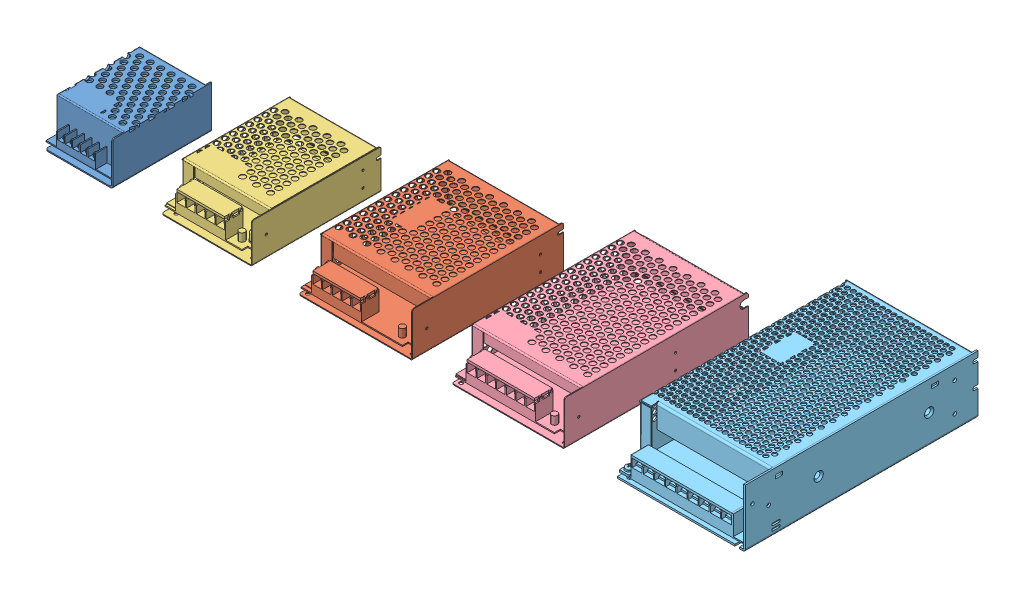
SolidWorks assembly Montagem1.sldasm, configuration Valor predeterminado (file format 12000). Lengths in mm.
Overall size (600.39 50 201.54).
5 component instances, 5 part files, 4 mates.
Components (placement in the parent):
- MS-25-12-1: MS-25-12.SLDPRT [Valor predeterminado] at (-56.4158 -52.4246 -56.0697) size (58.03 37.07 95)
- S - 35 - 24.3D-1: S - 35 - 24.3D.SLDPRT [Valor predeterminado] at (289.6752 -111.4579 0.9164) x (1 0 0) z (0 1 0) size (98 140 38)
- MS-60-12.3D-1: MS-60-12.3D.SLDPRT [Valor predeterminado] at (170.743 -111.4579 -0.1199) x (1 0 0) z (0 1 0) size (78 121 34.34)
- MS-100-12.3D-1: MS-100-12.3D.SLDPRT [Valor predeterminado] at (422.0298 -111.4579 1.4788) x (1 0 0) z (0 1 0) size (97 168 38.07)
- MS - 201 - 12.3D-1: MS - 201 - 12.3D.SLDPRT [Valor predeterminado] at (549.2178 -191.6558 -70.3767) x (1 0 0) z (0 1 0) size (110 207.23 50)
Mates (geometry in assembly coordinates):
- Coincidente3: coincident aligned: plane of MS-100-12.3D-1 through (306.1267 -17.4942 36.9076) normal (0 -1 0); plane of MS - 201 - 12.3D-1 through (454.6282 -17.4942 -160.0397) normal (0 -1 0)
- Coincidente4: coincident aligned: plane of S - 35 - 24.3D-1 through (173.7721 -17.4942 36.3452) normal (0 -1 0); plane of MS-100-12.3D-1 through (306.1267 -17.4942 36.9076) normal (0 -1 0)
- Coincidente5: coincident aligned: plane of S - 35 - 24.3D-1 through (173.7721 -17.4942 36.3452) normal (0 -1 0); plane of MS-60-12.3D-1 through (54.8399 -17.4942 35.3089) normal (0 -1 0)
- Coincidente6: coincident aligned: plane of MS-25-12-1 through (-15.6972 -17.4942 -12.7655) normal (0 -1 0); plane of MS-60-12.3D-1 through (54.8399 -17.4942 35.3089) normal (0 -1 0)
